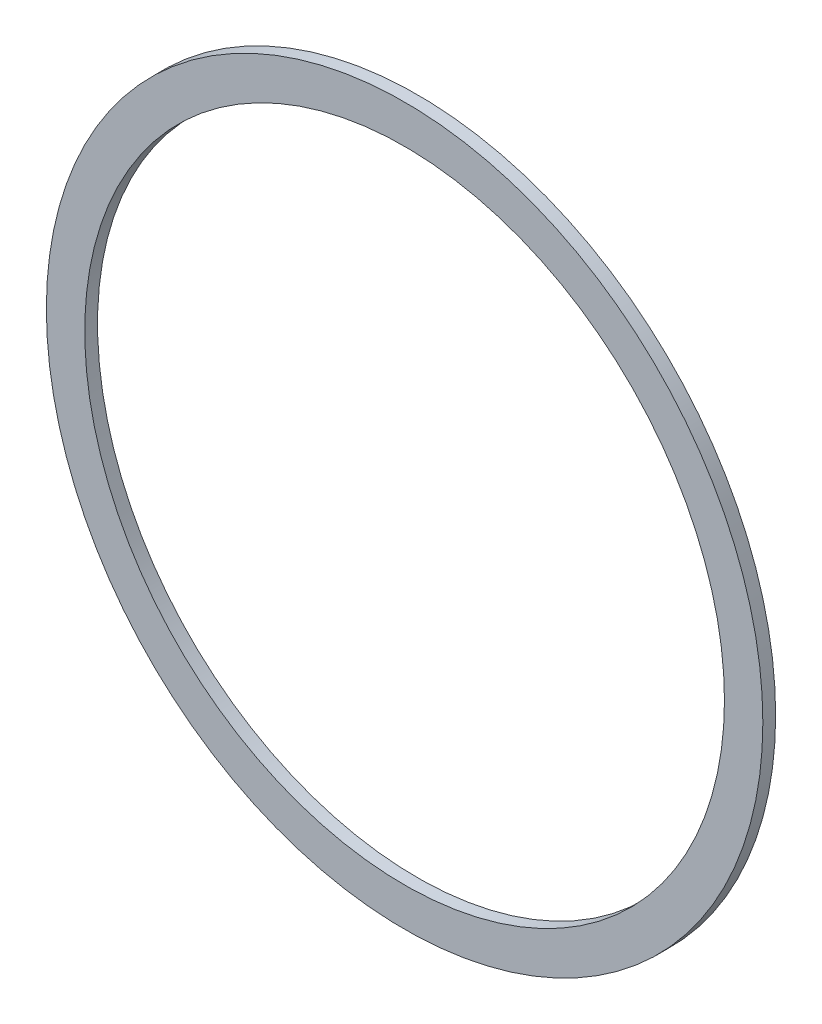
from build123d import *

# Parameters (mm, degrees)
SKETCH_1_R      = 28
SKETCH_1_R_2    = 25
EXTRUDE_1_DEPTH = 1


with BuildPart() as part:
    # Sketch 1 → Extrude 1 (new body)
    with BuildSketch(Plane.XY):
        Circle(SKETCH_1_R)
        Circle(SKETCH_1_R_2, mode=Mode.SUBTRACT)
    extrude(amount=EXTRUDE_1_DEPTH)


solid = part.part
